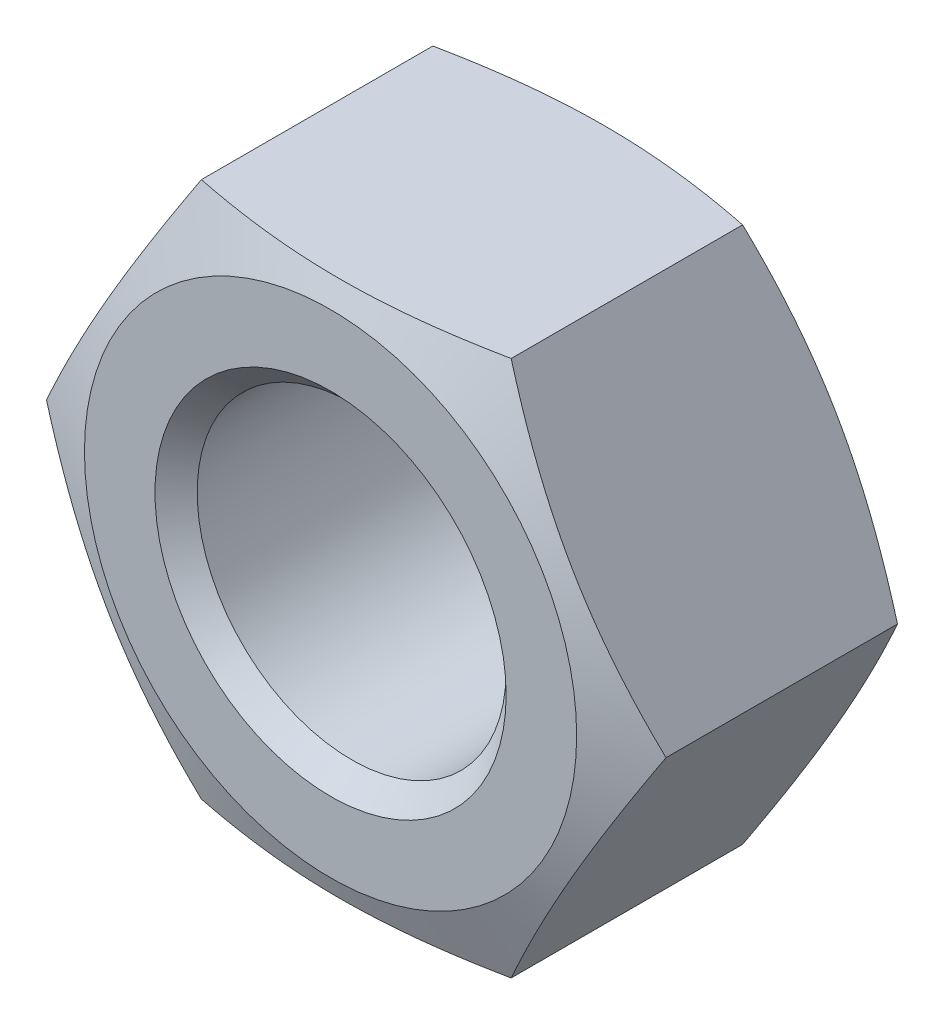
ISO-10303-21;
HEADER;
FILE_DESCRIPTION(('STEP AP214'),'2;1');
FILE_NAME('part.step','',(''),(''),'','','');
FILE_SCHEMA(('AUTOMOTIVE_DESIGN { 1 0 10303 214 1 1 1 1 }'));
ENDSEC;
DATA;
#1=APPLICATION_CONTEXT('core data for automotive mechanical design processes');
#2=APPLICATION_PROTOCOL_DEFINITION('international standard','automotive_design',2000,#1);
#3=PRODUCT_CONTEXT('',#1,'mechanical');
#4=PRODUCT('Part','Part','',(#3));
#5=PRODUCT_RELATED_PRODUCT_CATEGORY('part','',(#4));
#6=PRODUCT_DEFINITION_FORMATION('','',#4);
#7=PRODUCT_DEFINITION_CONTEXT('part definition',#1,'design');
#8=PRODUCT_DEFINITION('design','',#6,#7);
#9=PRODUCT_DEFINITION_SHAPE('','',#8);
#10=(LENGTH_UNIT() NAMED_UNIT(*) SI_UNIT(.MILLI.,.METRE.));
#11=(NAMED_UNIT(*) PLANE_ANGLE_UNIT() SI_UNIT($,.RADIAN.));
#12=(NAMED_UNIT(*) SI_UNIT($,.STERADIAN.) SOLID_ANGLE_UNIT());
#13=UNCERTAINTY_MEASURE_WITH_UNIT(LENGTH_MEASURE(1.E-05),#10,'distance_accuracy_value','');
#14=(GEOMETRIC_REPRESENTATION_CONTEXT(3) GLOBAL_UNCERTAINTY_ASSIGNED_CONTEXT((#13)) GLOBAL_UNIT_ASSIGNED_CONTEXT((#10,
#11,#12)) REPRESENTATION_CONTEXT('',''));
#15=CARTESIAN_POINT('',(0.,0.,0.));
#16=DIRECTION('',(0.,0.,1.));
#17=DIRECTION('',(1.,0.,0.));
#18=AXIS2_PLACEMENT_3D('',#15,#16,#17);
#19=CARTESIAN_POINT('',(-23.8156874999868,-13.749993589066,0.));
#20=DIRECTION('',(-0.866025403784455,-0.500000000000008,0.));
#21=DIRECTION('',(0.500000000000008,-0.866025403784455,0.));
#22=AXIS2_PLACEMENT_3D('',#19,#20,#21);
#23=PLANE('',#22);
#24=CARTESIAN_POINT('',(-31.7542499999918,2.4831265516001E-11,26.3636363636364));
#25=CARTESIAN_POINT('',(-23.8156875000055,-13.7499935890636,29.5710238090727));
#26=CARTESIAN_POINT('',(-15.8771249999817,-27.4999871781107,26.3636363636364));
#27=(BOUNDED_CURVE() B_SPLINE_CURVE(2,(#24,#25,#26),.UNSPECIFIED.,.F.,
.F.) B_SPLINE_CURVE_WITH_KNOTS((3,3),(0.,31.9397863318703),
.UNSPECIFIED.) CURVE() GEOMETRIC_REPRESENTATION_ITEM() RATIONAL_B_SPLINE_CURVE((1.,
1.15470053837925,1.)) REPRESENTATION_ITEM(''));
#28=CARTESIAN_POINT('',(-31.7542499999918,2.4831265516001E-11,26.3636363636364));
#29=VERTEX_POINT('',#28);
#30=CARTESIAN_POINT('',(-15.8771249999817,-27.4999871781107,26.3636363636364));
#31=VERTEX_POINT('',#30);
#32=EDGE_CURVE('E99',#29,#31,#27,.T.);
#33=ORIENTED_EDGE('',*,*,#32,.F.);
#34=DIRECTION('',(0.,0.,0.999999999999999));
#35=VECTOR('',#34,1.);
#36=CARTESIAN_POINT('',(-31.7542499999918,2.48642252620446E-11,0.));
#37=LINE('',#36,#35);
#38=CARTESIAN_POINT('',(-31.7542499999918,2.48382044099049E-11,2.63636363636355));
#39=VERTEX_POINT('',#38);
#40=EDGE_CURVE('E20',#39,#29,#37,.T.);
#41=ORIENTED_EDGE('',*,*,#40,.F.);
#42=CARTESIAN_POINT('',(-15.8771249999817,-27.4999871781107,2.63636363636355));
#43=CARTESIAN_POINT('',(-23.8156875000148,-13.749993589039,-0.571023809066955));
#44=CARTESIAN_POINT('',(-31.7542499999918,2.48382044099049E-11,2.63636363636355));
#45=(BOUNDED_CURVE() B_SPLINE_CURVE(2,(#42,#43,#44),.UNSPECIFIED.,.F.,
.F.) B_SPLINE_CURVE_WITH_KNOTS((3,3),(0.,31.9397863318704),
.UNSPECIFIED.) CURVE() GEOMETRIC_REPRESENTATION_ITEM() RATIONAL_B_SPLINE_CURVE((1.,
1.15470053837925,1.)) REPRESENTATION_ITEM(''));
#46=CARTESIAN_POINT('',(-15.8771249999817,-27.4999871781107,2.63636363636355));
#47=VERTEX_POINT('',#46);
#48=EDGE_CURVE('E133',#47,#39,#45,.T.);
#49=ORIENTED_EDGE('',*,*,#48,.F.);
#50=DIRECTION('',(0.,0.,0.999999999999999));
#51=VECTOR('',#50,1.);
#52=CARTESIAN_POINT('',(-15.8771249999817,-27.4999871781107,0.));
#53=LINE('',#52,#51);
#54=EDGE_CURVE('E11',#47,#31,#53,.T.);
#55=ORIENTED_EDGE('',*,*,#54,.T.);
#56=EDGE_LOOP('',(#33,#41,#49,#55));
#57=FACE_BOUND('',#56,.T.);
#58=ADVANCED_FACE('F16',(#57),#23,.T.);
#59=CARTESIAN_POINT('',(1.4212589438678E-11,-27.4999871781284,0.));
#60=DIRECTION('',(0.,-1.00000000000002,0.));
#61=DIRECTION('',(1.00000000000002,0.,0.));
#62=AXIS2_PLACEMENT_3D('',#59,#60,#61);
#63=PLANE('',#62);
#64=CARTESIAN_POINT('',(-15.8771249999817,-27.4999871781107,26.3636363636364));
#65=CARTESIAN_POINT('',(-3.07674029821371E-12,-27.4999871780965,29.5710238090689));
#66=CARTESIAN_POINT('',(15.8771250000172,-27.4999871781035,26.3636363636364));
#67=(BOUNDED_CURVE() B_SPLINE_CURVE(2,(#64,#65,#66),.UNSPECIFIED.,.F.,
.F.) B_SPLINE_CURVE_WITH_KNOTS((3,3),(0.,31.9397863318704),
.UNSPECIFIED.) CURVE() GEOMETRIC_REPRESENTATION_ITEM() RATIONAL_B_SPLINE_CURVE((1.,
1.15470053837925,1.)) REPRESENTATION_ITEM(''));
#68=CARTESIAN_POINT('',(15.8771250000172,-27.4999871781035,26.3636363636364));
#69=VERTEX_POINT('',#68);
#70=EDGE_CURVE('E103',#31,#69,#67,.T.);
#71=ORIENTED_EDGE('',*,*,#70,.F.);
#72=ORIENTED_EDGE('',*,*,#54,.F.);
#73=CARTESIAN_POINT('',(15.8771250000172,-27.4999871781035,2.63636363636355));
#74=CARTESIAN_POINT('',(-6.14146207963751E-12,-27.4999871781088,-0.571023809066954));
#75=CARTESIAN_POINT('',(-15.8771249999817,-27.4999871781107,2.63636363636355));
#76=(BOUNDED_CURVE() B_SPLINE_CURVE(2,(#73,#74,#75),.UNSPECIFIED.,.F.,
.F.) B_SPLINE_CURVE_WITH_KNOTS((3,3),(0.,31.9397863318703),
.UNSPECIFIED.) CURVE() GEOMETRIC_REPRESENTATION_ITEM() RATIONAL_B_SPLINE_CURVE((1.,
1.15470053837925,1.)) REPRESENTATION_ITEM(''));
#77=CARTESIAN_POINT('',(15.8771250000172,-27.4999871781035,2.63636363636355));
#78=VERTEX_POINT('',#77);
#79=EDGE_CURVE('E121',#78,#47,#76,.T.);
#80=ORIENTED_EDGE('',*,*,#79,.F.);
#81=DIRECTION('',(0.,0.,0.999999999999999));
#82=VECTOR('',#81,1.);
#83=CARTESIAN_POINT('',(15.8771250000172,-27.4999871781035,0.));
#84=LINE('',#83,#82);
#85=EDGE_CURVE('E27',#78,#69,#84,.T.);
#86=ORIENTED_EDGE('',*,*,#85,.T.);
#87=EDGE_LOOP('',(#71,#72,#80,#86));
#88=FACE_BOUND('',#87,.T.);
#89=ADVANCED_FACE('F221',(#88),#63,.T.);
#90=CARTESIAN_POINT('',(0.,0.,0.));
#91=DIRECTION('',(0.,0.,0.999999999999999));
#92=DIRECTION('',(1.00000000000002,0.,0.));
#93=AXIS2_PLACEMENT_3D('',#90,#91,#92);
#94=PLANE('',#93);
#95=CARTESIAN_POINT('',(0.,0.,0.));
#96=DIRECTION('',(0.,0.,0.999999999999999));
#97=DIRECTION('',(1.00000000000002,0.,0.));
#98=AXIS2_PLACEMENT_3D('',#95,#96,#97);
#99=CIRCLE('',#98,25.2290210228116);
#100=CARTESIAN_POINT('',(25.2290210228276,3.54447374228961E-12,0.));
#101=VERTEX_POINT('',#100);
#102=EDGE_CURVE('E149',#101,#101,#99,.T.);
#103=ORIENTED_EDGE('',*,*,#102,.F.);
#104=EDGE_LOOP('',(#103));
#105=FACE_BOUND('',#104,.T.);
#106=CARTESIAN_POINT('',(0.,0.,0.));
#107=DIRECTION('',(0.,0.,-0.999999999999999));
#108=DIRECTION('',(1.00000000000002,0.,0.));
#109=AXIS2_PLACEMENT_3D('',#106,#107,#108);
#110=CIRCLE('',#109,18.);
#111=CARTESIAN_POINT('',(18.0000000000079,1.4208686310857E-11,0.));
#112=VERTEX_POINT('',#111);
#113=EDGE_CURVE('E34',#112,#112,#110,.T.);
#114=ORIENTED_EDGE('',*,*,#113,.F.);
#115=EDGE_LOOP('',(#114));
#116=FACE_BOUND('',#115,.T.);
#117=ADVANCED_FACE('F248',(#105,#116),#94,.F.);
#118=CARTESIAN_POINT('',(0.,0.,28.9999999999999));
#119=DIRECTION('',(0.,0.,0.999999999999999));
#120=DIRECTION('',(1.00000000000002,0.,0.));
#121=AXIS2_PLACEMENT_3D('',#118,#119,#120);
#122=PLANE('',#121);
#123=CARTESIAN_POINT('',(0.,0.,28.9999999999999));
#124=DIRECTION('',(0.,0.,-0.999999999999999));
#125=DIRECTION('',(1.00000000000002,0.,0.));
#126=AXIS2_PLACEMENT_3D('',#123,#124,#125);
#127=CIRCLE('',#126,25.2290210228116);
#128=CARTESIAN_POINT('',(25.2290210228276,3.55661680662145E-12,28.9999999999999));
#129=VERTEX_POINT('',#128);
#130=EDGE_CURVE('E132',#129,#129,#127,.T.);
#131=ORIENTED_EDGE('',*,*,#130,.F.);
#132=EDGE_LOOP('',(#131));
#133=FACE_BOUND('',#132,.T.);
#134=CARTESIAN_POINT('',(0.,0.,28.9999999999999));
#135=DIRECTION('',(0.,0.,0.999999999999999));
#136=DIRECTION('',(1.00000000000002,0.,0.));
#137=AXIS2_PLACEMENT_3D('',#134,#135,#136);
#138=CIRCLE('',#137,18.);
#139=CARTESIAN_POINT('',(18.0000000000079,1.4214757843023E-11,28.9999999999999));
#140=VERTEX_POINT('',#139);
#141=EDGE_CURVE('E150',#140,#140,#138,.T.);
#142=ORIENTED_EDGE('',*,*,#141,.F.);
#143=EDGE_LOOP('',(#142));
#144=FACE_BOUND('',#143,.T.);
#145=ADVANCED_FACE('F245',(#133,#144),#122,.T.);
#146=CARTESIAN_POINT('',(23.8156875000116,-13.7499935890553,0.));
#147=DIRECTION('',(0.866025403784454,-0.500000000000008,0.));
#148=DIRECTION('',(0.500000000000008,0.866025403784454,0.));
#149=AXIS2_PLACEMENT_3D('',#146,#147,#148);
#150=PLANE('',#149);
#151=CARTESIAN_POINT('',(15.8771250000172,-27.4999871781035,26.3636363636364));
#152=CARTESIAN_POINT('',(23.8156875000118,-13.7499935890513,29.5710238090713));
#153=CARTESIAN_POINT('',(31.7542499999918,3.53233067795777E-12,26.3636363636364));
#154=(BOUNDED_CURVE() B_SPLINE_CURVE(2,(#151,#152,#153),.UNSPECIFIED.,.F.,
.F.) B_SPLINE_CURVE_WITH_KNOTS((3,3),(0.,31.9397863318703),
.UNSPECIFIED.) CURVE() GEOMETRIC_REPRESENTATION_ITEM() RATIONAL_B_SPLINE_CURVE((1.,
1.15470053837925,1.)) REPRESENTATION_ITEM(''));
#155=CARTESIAN_POINT('',(31.7542499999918,3.53233067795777E-12,26.3636363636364));
#156=VERTEX_POINT('',#155);
#157=EDGE_CURVE('E141',#69,#156,#154,.T.);
#158=ORIENTED_EDGE('',*,*,#157,.F.);
#159=ORIENTED_EDGE('',*,*,#85,.F.);
#160=CARTESIAN_POINT('',(31.7542499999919,3.54273901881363E-12,2.63636363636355));
#161=CARTESIAN_POINT('',(23.8156875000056,-13.7499935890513,-0.571023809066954));
#162=CARTESIAN_POINT('',(15.8771250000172,-27.4999871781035,2.63636363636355));
#163=(BOUNDED_CURVE() B_SPLINE_CURVE(2,(#160,#161,#162),.UNSPECIFIED.,.F.,
.F.) B_SPLINE_CURVE_WITH_KNOTS((3,3),(0.,31.9397863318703),
.UNSPECIFIED.) CURVE() GEOMETRIC_REPRESENTATION_ITEM() RATIONAL_B_SPLINE_CURVE((1.,
1.15470053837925,1.)) REPRESENTATION_ITEM(''));
#164=CARTESIAN_POINT('',(31.7542499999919,3.54273901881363E-12,2.63636363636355));
#165=VERTEX_POINT('',#164);
#166=EDGE_CURVE('E202',#165,#78,#163,.T.);
#167=ORIENTED_EDGE('',*,*,#166,.F.);
#168=DIRECTION('',(0.,0.,0.999999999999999));
#169=VECTOR('',#168,1.);
#170=CARTESIAN_POINT('',(31.7542499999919,3.55835153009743E-12,0.));
#171=LINE('',#170,#169);
#172=EDGE_CURVE('E180',#165,#156,#171,.T.);
#173=ORIENTED_EDGE('',*,*,#172,.T.);
#174=EDGE_LOOP('',(#158,#159,#167,#173));
#175=FACE_BOUND('',#174,.T.);
#176=ADVANCED_FACE('F224',(#175),#150,.T.);
#177=CARTESIAN_POINT('',(23.8156874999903,13.7499935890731,0.));
#178=DIRECTION('',(0.866025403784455,0.500000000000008,0.));
#179=DIRECTION('',(-0.500000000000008,0.866025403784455,0.));
#180=AXIS2_PLACEMENT_3D('',#177,#178,#179);
#181=PLANE('',#180);
#182=CARTESIAN_POINT('',(31.7542499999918,3.53233067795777E-12,26.3636363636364));
#183=CARTESIAN_POINT('',(23.8156874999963,13.7499935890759,29.5710238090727));
#184=CARTESIAN_POINT('',(15.8771250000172,27.499987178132,26.3636363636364));
#185=(BOUNDED_CURVE() B_SPLINE_CURVE(2,(#182,#183,#184),.UNSPECIFIED.,.F.,
.F.) B_SPLINE_CURVE_WITH_KNOTS((3,3),(0.,31.9397863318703),
.UNSPECIFIED.) CURVE() GEOMETRIC_REPRESENTATION_ITEM() RATIONAL_B_SPLINE_CURVE((1.,
1.15470053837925,1.)) REPRESENTATION_ITEM(''));
#186=CARTESIAN_POINT('',(15.8771250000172,27.499987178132,26.3636363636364));
#187=VERTEX_POINT('',#186);
#188=EDGE_CURVE('E115',#156,#187,#185,.T.);
#189=ORIENTED_EDGE('',*,*,#188,.F.);
#190=ORIENTED_EDGE('',*,*,#172,.F.);
#191=CARTESIAN_POINT('',(15.8771250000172,27.499987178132,2.63636363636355));
#192=CARTESIAN_POINT('',(23.8156874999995,13.749993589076,-0.571023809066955));
#193=CARTESIAN_POINT('',(31.7542499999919,3.54273901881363E-12,2.63636363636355));
#194=(BOUNDED_CURVE() B_SPLINE_CURVE(2,(#191,#192,#193),.UNSPECIFIED.,.F.,
.F.) B_SPLINE_CURVE_WITH_KNOTS((3,3),(0.,31.9397863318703),
.UNSPECIFIED.) CURVE() GEOMETRIC_REPRESENTATION_ITEM() RATIONAL_B_SPLINE_CURVE((1.,
1.15470053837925,1.)) REPRESENTATION_ITEM(''));
#195=CARTESIAN_POINT('',(15.8771250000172,27.499987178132,2.63636363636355));
#196=VERTEX_POINT('',#195);
#197=EDGE_CURVE('E177',#196,#165,#194,.T.);
#198=ORIENTED_EDGE('',*,*,#197,.F.);
#199=DIRECTION('',(0.,0.,0.999999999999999));
#200=VECTOR('',#199,1.);
#201=CARTESIAN_POINT('',(15.8771250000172,27.499987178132,0.));
#202=LINE('',#201,#200);
#203=EDGE_CURVE('E96',#196,#187,#202,.T.);
#204=ORIENTED_EDGE('',*,*,#203,.T.);
#205=EDGE_LOOP('',(#189,#190,#198,#204));
#206=FACE_BOUND('',#205,.T.);
#207=ADVANCED_FACE('F228',(#206),#181,.T.);
#208=CARTESIAN_POINT('',(-3.54837687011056E-12,27.4999871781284,0.));
#209=DIRECTION('',(0.,1.00000000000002,0.));
#210=DIRECTION('',(-1.00000000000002,0.,0.));
#211=AXIS2_PLACEMENT_3D('',#208,#209,#210);
#212=PLANE('',#211);
#213=CARTESIAN_POINT('',(15.8771250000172,27.499987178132,26.3636363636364));
#214=CARTESIAN_POINT('',(1.53754387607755E-11,27.4999871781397,29.5710238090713));
#215=CARTESIAN_POINT('',(-15.8771249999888,27.4999871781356,26.3636363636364));
#216=(BOUNDED_CURVE() B_SPLINE_CURVE(2,(#213,#214,#215),.UNSPECIFIED.,.F.,
.F.) B_SPLINE_CURVE_WITH_KNOTS((3,3),(0.,31.9397863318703),
.UNSPECIFIED.) CURVE() GEOMETRIC_REPRESENTATION_ITEM() RATIONAL_B_SPLINE_CURVE((1.,
1.15470053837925,1.)) REPRESENTATION_ITEM(''));
#217=CARTESIAN_POINT('',(-15.8771249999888,27.4999871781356,26.3636363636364));
#218=VERTEX_POINT('',#217);
#219=EDGE_CURVE('E109',#187,#218,#216,.T.);
#220=ORIENTED_EDGE('',*,*,#219,.F.);
#221=ORIENTED_EDGE('',*,*,#203,.F.);
#222=CARTESIAN_POINT('',(-15.8771249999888,27.4999871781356,2.63636363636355));
#223=CARTESIAN_POINT('',(-3.07073103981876E-12,27.4999871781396,-0.571023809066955));
#224=CARTESIAN_POINT('',(15.8771250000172,27.499987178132,2.63636363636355));
#225=(BOUNDED_CURVE() B_SPLINE_CURVE(2,(#222,#223,#224),.UNSPECIFIED.,.F.,
.F.) B_SPLINE_CURVE_WITH_KNOTS((3,3),(0.,31.9397863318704),
.UNSPECIFIED.) CURVE() GEOMETRIC_REPRESENTATION_ITEM() RATIONAL_B_SPLINE_CURVE((1.,
1.15470053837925,1.)) REPRESENTATION_ITEM(''));
#226=CARTESIAN_POINT('',(-15.8771249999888,27.4999871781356,2.63636363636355));
#227=VERTEX_POINT('',#226);
#228=EDGE_CURVE('E190',#227,#196,#225,.T.);
#229=ORIENTED_EDGE('',*,*,#228,.F.);
#230=DIRECTION('',(0.,0.,0.999999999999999));
#231=VECTOR('',#230,1.);
#232=CARTESIAN_POINT('',(-15.8771249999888,27.4999871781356,0.));
#233=LINE('',#232,#231);
#234=EDGE_CURVE('E97',#227,#218,#233,.T.);
#235=ORIENTED_EDGE('',*,*,#234,.T.);
#236=EDGE_LOOP('',(#220,#221,#229,#235));
#237=FACE_BOUND('',#236,.T.);
#238=ADVANCED_FACE('F234',(#237),#212,.T.);
#239=CARTESIAN_POINT('',(-23.8156874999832,13.7499935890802,0.));
#240=DIRECTION('',(-0.866025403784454,0.500000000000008,0.));
#241=DIRECTION('',(-0.500000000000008,-0.866025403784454,0.));
#242=AXIS2_PLACEMENT_3D('',#239,#240,#241);
#243=PLANE('',#242);
#244=CARTESIAN_POINT('',(-15.8771249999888,27.4999871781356,26.3636363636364));
#245=CARTESIAN_POINT('',(-23.8156874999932,13.7499935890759,29.5710238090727));
#246=CARTESIAN_POINT('',(-31.7542499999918,2.4831265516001E-11,26.3636363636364));
#247=(BOUNDED_CURVE() B_SPLINE_CURVE(2,(#244,#245,#246),.UNSPECIFIED.,.F.,
.F.) B_SPLINE_CURVE_WITH_KNOTS((3,3),(0.,31.9397863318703),
.UNSPECIFIED.) CURVE() GEOMETRIC_REPRESENTATION_ITEM() RATIONAL_B_SPLINE_CURVE((1.,
1.15470053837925,1.)) REPRESENTATION_ITEM(''));
#248=EDGE_CURVE('E90',#218,#29,#247,.T.);
#249=ORIENTED_EDGE('',*,*,#248,.F.);
#250=ORIENTED_EDGE('',*,*,#234,.F.);
#251=CARTESIAN_POINT('',(-31.7542499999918,2.48382044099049E-11,2.63636363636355));
#252=CARTESIAN_POINT('',(-23.8156874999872,13.7499935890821,-0.571023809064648));
#253=CARTESIAN_POINT('',(-15.8771249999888,27.4999871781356,2.63636363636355));
#254=(BOUNDED_CURVE() B_SPLINE_CURVE(2,(#251,#252,#253),.UNSPECIFIED.,.F.,
.F.) B_SPLINE_CURVE_WITH_KNOTS((3,3),(0.,31.9397863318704),
.UNSPECIFIED.) CURVE() GEOMETRIC_REPRESENTATION_ITEM() RATIONAL_B_SPLINE_CURVE((1.,
1.15470053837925,1.)) REPRESENTATION_ITEM(''));
#255=EDGE_CURVE('E93',#39,#227,#254,.T.);
#256=ORIENTED_EDGE('',*,*,#255,.F.);
#257=ORIENTED_EDGE('',*,*,#40,.T.);
#258=EDGE_LOOP('',(#249,#250,#256,#257));
#259=FACE_BOUND('',#258,.T.);
#260=ADVANCED_FACE('F88',(#259),#243,.T.);
#261=CARTESIAN_POINT('',(0.,0.,1.08249999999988));
#262=DIRECTION('',(0.,0.,-0.999999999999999));
#263=DIRECTION('',(1.00000000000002,0.,0.));
#264=AXIS2_PLACEMENT_3D('',#261,#262,#263);
#265=CONICAL_SURFACE('',#264,16.9175,0.785398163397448);
#266=CARTESIAN_POINT('',(0.,0.,2.16499999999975));
#267=DIRECTION('',(0.,0.,0.999999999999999));
#268=DIRECTION('',(1.00000000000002,0.,0.));
#269=AXIS2_PLACEMENT_3D('',#266,#267,#268);
#270=CIRCLE('',#269,15.835);
#271=CARTESIAN_POINT('',(15.835000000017,1.77640020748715E-11,2.16499999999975));
#272=VERTEX_POINT('',#271);
#273=EDGE_CURVE('E156',#272,#272,#270,.T.);
#274=ORIENTED_EDGE('',*,*,#273,.T.);
#275=EDGE_LOOP('',(#274));
#276=FACE_BOUND('',#275,.T.);
#277=ORIENTED_EDGE('',*,*,#113,.T.);
#278=EDGE_LOOP('',(#277));
#279=FACE_BOUND('',#278,.T.);
#280=ADVANCED_FACE('F259',(#276,#279),#265,.F.);
#281=CARTESIAN_POINT('',(0.,0.,14.5));
#282=DIRECTION('',(0.,0.,-0.999999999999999));
#283=DIRECTION('',(1.00000000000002,0.,0.));
#284=AXIS2_PLACEMENT_3D('',#281,#282,#283);
#285=CYLINDRICAL_SURFACE('',#284,15.835);
#286=CARTESIAN_POINT('',(0.,0.,26.8350000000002));
#287=DIRECTION('',(0.,0.,0.999999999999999));
#288=DIRECTION('',(1.00000000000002,0.,0.));
#289=AXIS2_PLACEMENT_3D('',#286,#287,#288);
#290=CIRCLE('',#289,15.835);
#291=CARTESIAN_POINT('',(15.835000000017,1.77640020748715E-11,26.8350000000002));
#292=VERTEX_POINT('',#291);
#293=EDGE_CURVE('E157',#292,#292,#290,.T.);
#294=ORIENTED_EDGE('',*,*,#293,.T.);
#295=EDGE_LOOP('',(#294));
#296=FACE_BOUND('',#295,.T.);
#297=ORIENTED_EDGE('',*,*,#273,.F.);
#298=EDGE_LOOP('',(#297));
#299=FACE_BOUND('',#298,.T.);
#300=ADVANCED_FACE('F254',(#296,#299),#285,.F.);
#301=CARTESIAN_POINT('',(0.,0.,27.9175));
#302=DIRECTION('',(0.,0.,0.999999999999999));
#303=DIRECTION('',(1.00000000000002,0.,0.));
#304=AXIS2_PLACEMENT_3D('',#301,#302,#303);
#305=CONICAL_SURFACE('',#304,16.9175,0.785398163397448);
#306=ORIENTED_EDGE('',*,*,#141,.T.);
#307=EDGE_LOOP('',(#306));
#308=FACE_BOUND('',#307,.T.);
#309=ORIENTED_EDGE('',*,*,#293,.F.);
#310=EDGE_LOOP('',(#309));
#311=FACE_BOUND('',#310,.T.);
#312=ADVANCED_FACE('F18',(#308,#311),#305,.F.);
#313=CARTESIAN_POINT('',(0.,0.,27.6818181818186));
#314=DIRECTION('',(0.,0.,-0.999999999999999));
#315=DIRECTION('',(1.00000000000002,0.,0.));
#316=AXIS2_PLACEMENT_3D('',#313,#314,#315);
#317=CONICAL_SURFACE('',#316,28.4916355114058,1.18682389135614);
#318=ORIENTED_EDGE('',*,*,#130,.T.);
#319=EDGE_LOOP('',(#318));
#320=FACE_BOUND('',#319,.T.);
#321=ORIENTED_EDGE('',*,*,#157,.T.);
#322=ORIENTED_EDGE('',*,*,#188,.T.);
#323=ORIENTED_EDGE('',*,*,#219,.T.);
#324=ORIENTED_EDGE('',*,*,#248,.T.);
#325=ORIENTED_EDGE('',*,*,#32,.T.);
#326=ORIENTED_EDGE('',*,*,#70,.T.);
#327=EDGE_LOOP('',(#321,#322,#323,#324,#325,#326));
#328=FACE_BOUND('',#327,.T.);
#329=ADVANCED_FACE('F106',(#320,#328),#317,.T.);
#330=CARTESIAN_POINT('',(0.,0.,1.31818181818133));
#331=DIRECTION('',(0.,0.,0.999999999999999));
#332=DIRECTION('',(1.00000000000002,0.,0.));
#333=AXIS2_PLACEMENT_3D('',#330,#331,#332);
#334=CONICAL_SURFACE('',#333,28.4916355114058,1.18682389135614);
#335=ORIENTED_EDGE('',*,*,#102,.T.);
#336=EDGE_LOOP('',(#335));
#337=FACE_BOUND('',#336,.T.);
#338=ORIENTED_EDGE('',*,*,#166,.T.);
#339=ORIENTED_EDGE('',*,*,#79,.T.);
#340=ORIENTED_EDGE('',*,*,#48,.T.);
#341=ORIENTED_EDGE('',*,*,#255,.T.);
#342=ORIENTED_EDGE('',*,*,#228,.T.);
#343=ORIENTED_EDGE('',*,*,#197,.T.);
#344=EDGE_LOOP('',(#338,#339,#340,#341,#342,#343));
#345=FACE_BOUND('',#344,.T.);
#346=ADVANCED_FACE('F219',(#337,#345),#334,.T.);
#347=CLOSED_SHELL('',(#58,#89,#117,#145,#176,#207,#238,#260,#280,#300,#312,#329,#346));
#348=MANIFOLD_SOLID_BREP('B1',#347);
#349=ADVANCED_BREP_SHAPE_REPRESENTATION('',(#18,#348),#14);
#350=SHAPE_DEFINITION_REPRESENTATION(#9,#349);
ENDSEC;
END-ISO-10303-21;
